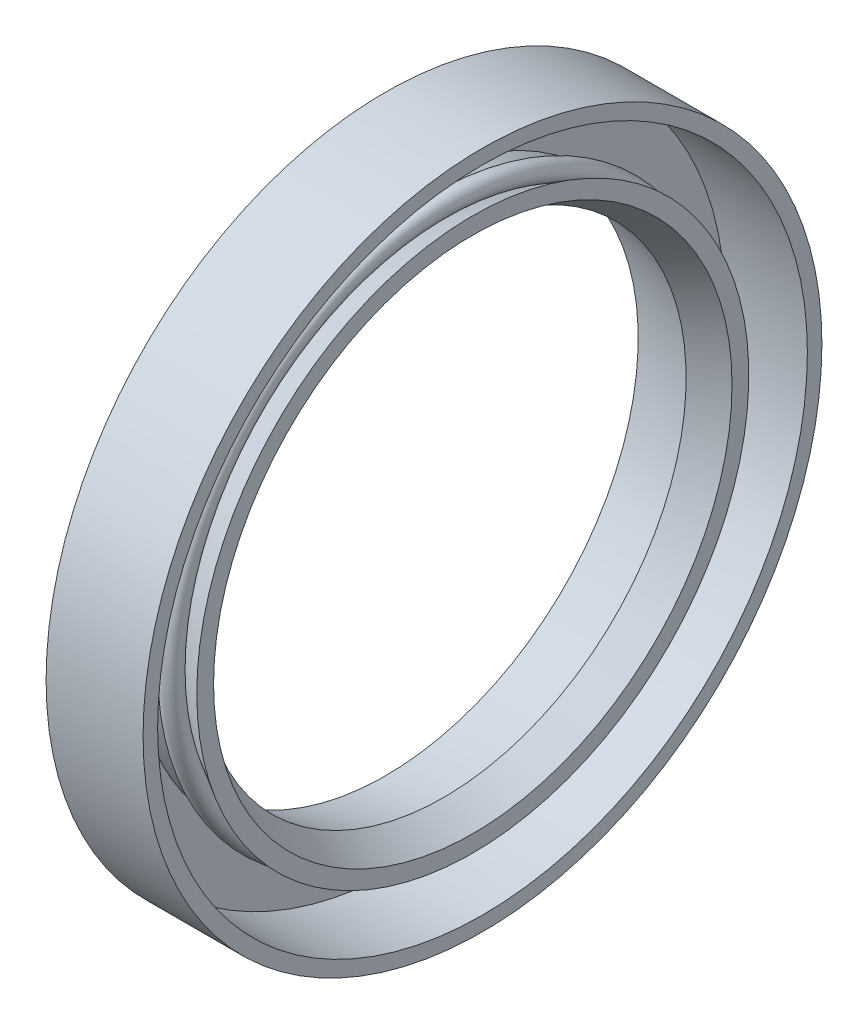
ISO-10303-21;
HEADER;
FILE_DESCRIPTION(('STEP AP214'),'2;1');
FILE_NAME('part.step','',(''),(''),'','','');
FILE_SCHEMA(('AUTOMOTIVE_DESIGN { 1 0 10303 214 1 1 1 1 }'));
ENDSEC;
DATA;
#1=APPLICATION_CONTEXT('core data for automotive mechanical design processes');
#2=APPLICATION_PROTOCOL_DEFINITION('international standard','automotive_design',2000,#1);
#3=PRODUCT_CONTEXT('',#1,'mechanical');
#4=PRODUCT('Part','Part','',(#3));
#5=PRODUCT_RELATED_PRODUCT_CATEGORY('part','',(#4));
#6=PRODUCT_DEFINITION_FORMATION('','',#4);
#7=PRODUCT_DEFINITION_CONTEXT('part definition',#1,'design');
#8=PRODUCT_DEFINITION('design','',#6,#7);
#9=PRODUCT_DEFINITION_SHAPE('','',#8);
#10=(LENGTH_UNIT() NAMED_UNIT(*) SI_UNIT(.MILLI.,.METRE.));
#11=(NAMED_UNIT(*) PLANE_ANGLE_UNIT() SI_UNIT($,.RADIAN.));
#12=(NAMED_UNIT(*) SI_UNIT($,.STERADIAN.) SOLID_ANGLE_UNIT());
#13=UNCERTAINTY_MEASURE_WITH_UNIT(LENGTH_MEASURE(1.E-05),#10,'distance_accuracy_value','');
#14=(GEOMETRIC_REPRESENTATION_CONTEXT(3) GLOBAL_UNCERTAINTY_ASSIGNED_CONTEXT((#13)) GLOBAL_UNIT_ASSIGNED_CONTEXT((#10,
#11,#12)) REPRESENTATION_CONTEXT('',''));
#15=CARTESIAN_POINT('',(0.,0.,0.));
#16=DIRECTION('',(0.,0.,1.));
#17=DIRECTION('',(1.,0.,0.));
#18=AXIS2_PLACEMENT_3D('',#15,#16,#17);
#19=CARTESIAN_POINT('',(5.53801867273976,0.,0.));
#20=DIRECTION('',(-1.,0.,0.));
#21=DIRECTION('',(0.,0.,1.));
#22=AXIS2_PLACEMENT_3D('',#19,#20,#21);
#23=TOROIDAL_SURFACE('',#22,27.6200263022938,1.);
#24=CARTESIAN_POINT('',(5.53801867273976,0.,28.6200263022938));
#25=VERTEX_POINT('',#24);
#26=VERTEX_LOOP('',#25);
#27=FACE_BOUND('',#26,.T.);
#28=ADVANCED_FACE('F446',(#27),#23,.T.);
#29=CLOSED_SHELL('',(#28));
#30=MANIFOLD_SOLID_BREP('B2',#29);
#31=CARTESIAN_POINT('',(0.,0.,0.));
#32=DIRECTION('',(-1.,0.,0.));
#33=DIRECTION('',(0.,0.,1.));
#34=AXIS2_PLACEMENT_3D('',#31,#32,#33);
#35=CONICAL_SURFACE('',#34,26.0579618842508,0.17453292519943);
#36=CARTESIAN_POINT('',(6.00000000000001,0.,0.));
#37=DIRECTION('',(-1.,0.,0.));
#38=DIRECTION('',(0.,0.,1.));
#39=AXIS2_PLACEMENT_3D('',#36,#37,#38);
#40=CIRCLE('',#39,25.);
#41=CARTESIAN_POINT('',(6.00000000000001,0.,25.));
#42=VERTEX_POINT('',#41);
#43=EDGE_CURVE('E445',#42,#42,#40,.T.);
#44=ORIENTED_EDGE('',*,*,#43,.F.);
#45=EDGE_LOOP('',(#44));
#46=FACE_BOUND('',#45,.T.);
#47=CARTESIAN_POINT('',(0.,0.,0.));
#48=DIRECTION('',(-1.,0.,0.));
#49=DIRECTION('',(0.,0.,1.));
#50=AXIS2_PLACEMENT_3D('',#47,#48,#49);
#51=CIRCLE('',#50,26.0579618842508);
#52=CARTESIAN_POINT('',(0.,0.,26.0579618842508));
#53=VERTEX_POINT('',#52);
#54=EDGE_CURVE('E491',#53,#53,#51,.T.);
#55=ORIENTED_EDGE('',*,*,#54,.T.);
#56=EDGE_LOOP('',(#55));
#57=FACE_BOUND('',#56,.T.);
#58=ADVANCED_FACE('F454',(#46,#57),#35,.F.);
#59=CARTESIAN_POINT('',(6.00000000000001,0.,0.));
#60=DIRECTION('',(1.,0.,0.));
#61=DIRECTION('',(0.,0.,-1.));
#62=AXIS2_PLACEMENT_3D('',#59,#60,#61);
#63=CONICAL_SURFACE('',#62,25.,0.523598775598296);
#64=CARTESIAN_POINT('',(9.00000000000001,0.,0.));
#65=DIRECTION('',(-1.,0.,0.));
#66=DIRECTION('',(0.,0.,1.));
#67=AXIS2_PLACEMENT_3D('',#64,#65,#66);
#68=CIRCLE('',#67,26.7320508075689);
#69=CARTESIAN_POINT('',(9.00000000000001,0.,26.7320508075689));
#70=VERTEX_POINT('',#69);
#71=EDGE_CURVE('E460',#70,#70,#68,.T.);
#72=ORIENTED_EDGE('',*,*,#71,.F.);
#73=EDGE_LOOP('',(#72));
#74=FACE_BOUND('',#73,.T.);
#75=ORIENTED_EDGE('',*,*,#43,.T.);
#76=EDGE_LOOP('',(#75));
#77=FACE_BOUND('',#76,.T.);
#78=ADVANCED_FACE('F546',(#74,#77),#63,.F.);
#79=CARTESIAN_POINT('',(9.00000000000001,28.4641016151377,0.));
#80=DIRECTION('',(-1.,0.,0.));
#81=DIRECTION('',(0.,0.,1.));
#82=AXIS2_PLACEMENT_3D('',#79,#80,#81);
#83=PLANE('',#82);
#84=CARTESIAN_POINT('',(9.00000000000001,0.,0.));
#85=DIRECTION('',(-1.,0.,0.));
#86=DIRECTION('',(0.,0.,1.));
#87=AXIS2_PLACEMENT_3D('',#84,#85,#86);
#88=CIRCLE('',#87,28.4641016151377);
#89=CARTESIAN_POINT('',(9.00000000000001,0.,28.4641016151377));
#90=VERTEX_POINT('',#89);
#91=EDGE_CURVE('E464',#90,#90,#88,.T.);
#92=ORIENTED_EDGE('',*,*,#91,.F.);
#93=EDGE_LOOP('',(#92));
#94=FACE_BOUND('',#93,.T.);
#95=ORIENTED_EDGE('',*,*,#71,.T.);
#96=EDGE_LOOP('',(#95));
#97=FACE_BOUND('',#96,.T.);
#98=ADVANCED_FACE('F541',(#94,#97),#83,.F.);
#99=CARTESIAN_POINT('',(9.00000000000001,0.,0.));
#100=DIRECTION('',(1.,0.,0.));
#101=DIRECTION('',(0.,0.,-1.));
#102=AXIS2_PLACEMENT_3D('',#99,#100,#101);
#103=CONICAL_SURFACE('',#102,28.4641016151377,0.523598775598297);
#104=CARTESIAN_POINT('',(6.03801867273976,0.,0.));
#105=DIRECTION('',(-1.,0.,0.));
#106=DIRECTION('',(0.,0.,1.));
#107=AXIS2_PLACEMENT_3D('',#104,#105,#106);
#108=CIRCLE('',#107,26.7540008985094);
#109=CARTESIAN_POINT('',(6.03801867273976,0.,26.7540008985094));
#110=VERTEX_POINT('',#109);
#111=EDGE_CURVE('E468',#110,#110,#108,.T.);
#112=ORIENTED_EDGE('',*,*,#111,.F.);
#113=EDGE_LOOP('',(#112));
#114=FACE_BOUND('',#113,.T.);
#115=ORIENTED_EDGE('',*,*,#91,.T.);
#116=EDGE_LOOP('',(#115));
#117=FACE_BOUND('',#116,.T.);
#118=ADVANCED_FACE('F535',(#114,#117),#103,.T.);
#119=CARTESIAN_POINT('',(5.53801867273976,0.,0.));
#120=DIRECTION('',(-1.,0.,0.));
#121=DIRECTION('',(0.,0.,1.));
#122=AXIS2_PLACEMENT_3D('',#119,#120,#121);
#123=TOROIDAL_SURFACE('',#122,27.6200263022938,1.);
#124=CARTESIAN_POINT('',(5.36437049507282,0.,0.));
#125=DIRECTION('',(-1.,0.,0.));
#126=DIRECTION('',(0.,0.,1.));
#127=AXIS2_PLACEMENT_3D('',#124,#125,#126);
#128=CIRCLE('',#127,26.6352185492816);
#129=CARTESIAN_POINT('',(5.36437049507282,0.,26.6352185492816));
#130=VERTEX_POINT('',#129);
#131=EDGE_CURVE('E473',#130,#130,#128,.T.);
#132=ORIENTED_EDGE('',*,*,#131,.F.);
#133=EDGE_LOOP('',(#132));
#134=FACE_BOUND('',#133,.T.);
#135=ORIENTED_EDGE('',*,*,#111,.T.);
#136=EDGE_LOOP('',(#135));
#137=FACE_BOUND('',#136,.T.);
#138=ADVANCED_FACE('F529',(#134,#137),#123,.F.);
#139=CARTESIAN_POINT('',(5.36437049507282,0.,0.));
#140=DIRECTION('',(-1.,0.,0.));
#141=DIRECTION('',(0.,0.,1.));
#142=AXIS2_PLACEMENT_3D('',#139,#140,#141);
#143=CONICAL_SURFACE('',#142,26.6352185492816,0.174532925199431);
#144=CARTESIAN_POINT('',(1.5,0.,0.));
#145=DIRECTION('',(-1.,0.,0.));
#146=DIRECTION('',(0.,0.,1.));
#147=AXIS2_PLACEMENT_3D('',#144,#145,#146);
#148=CIRCLE('',#147,27.3166113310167);
#149=CARTESIAN_POINT('',(1.5,0.,27.3166113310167));
#150=VERTEX_POINT('',#149);
#151=EDGE_CURVE('E476',#150,#150,#148,.T.);
#152=ORIENTED_EDGE('',*,*,#151,.F.);
#153=EDGE_LOOP('',(#152));
#154=FACE_BOUND('',#153,.T.);
#155=ORIENTED_EDGE('',*,*,#131,.T.);
#156=EDGE_LOOP('',(#155));
#157=FACE_BOUND('',#156,.T.);
#158=ADVANCED_FACE('F523',(#154,#157),#143,.T.);
#159=CARTESIAN_POINT('',(1.5,33.5,0.));
#160=DIRECTION('',(-1.,0.,0.));
#161=DIRECTION('',(0.,0.,1.));
#162=AXIS2_PLACEMENT_3D('',#159,#160,#161);
#163=PLANE('',#162);
#164=CARTESIAN_POINT('',(1.5,0.,0.));
#165=DIRECTION('',(-1.,0.,0.));
#166=DIRECTION('',(0.,0.,1.));
#167=AXIS2_PLACEMENT_3D('',#164,#165,#166);
#168=CIRCLE('',#167,33.5);
#169=CARTESIAN_POINT('',(1.5,0.,33.5));
#170=VERTEX_POINT('',#169);
#171=EDGE_CURVE('E479',#170,#170,#168,.T.);
#172=ORIENTED_EDGE('',*,*,#171,.F.);
#173=EDGE_LOOP('',(#172));
#174=FACE_BOUND('',#173,.T.);
#175=ORIENTED_EDGE('',*,*,#151,.T.);
#176=EDGE_LOOP('',(#175));
#177=FACE_BOUND('',#176,.T.);
#178=ADVANCED_FACE('F517',(#174,#177),#163,.F.);
#179=CARTESIAN_POINT('',(-26.6044395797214,0.,0.));
#180=DIRECTION('',(-1.,0.,0.));
#181=DIRECTION('',(0.,0.,1.));
#182=AXIS2_PLACEMENT_3D('',#179,#180,#181);
#183=CYLINDRICAL_SURFACE('',#182,33.5);
#184=CARTESIAN_POINT('',(10.,0.,0.));
#185=DIRECTION('',(-1.,0.,0.));
#186=DIRECTION('',(0.,0.,1.));
#187=AXIS2_PLACEMENT_3D('',#184,#185,#186);
#188=CIRCLE('',#187,33.5);
#189=CARTESIAN_POINT('',(10.,0.,33.5));
#190=VERTEX_POINT('',#189);
#191=EDGE_CURVE('E482',#190,#190,#188,.T.);
#192=ORIENTED_EDGE('',*,*,#191,.F.);
#193=EDGE_LOOP('',(#192));
#194=FACE_BOUND('',#193,.T.);
#195=ORIENTED_EDGE('',*,*,#171,.T.);
#196=EDGE_LOOP('',(#195));
#197=FACE_BOUND('',#196,.T.);
#198=ADVANCED_FACE('F511',(#194,#197),#183,.F.);
#199=CARTESIAN_POINT('',(10.,35.,0.));
#200=DIRECTION('',(-1.,0.,0.));
#201=DIRECTION('',(0.,0.,1.));
#202=AXIS2_PLACEMENT_3D('',#199,#200,#201);
#203=PLANE('',#202);
#204=CARTESIAN_POINT('',(10.,0.,0.));
#205=DIRECTION('',(-1.,0.,0.));
#206=DIRECTION('',(0.,0.,1.));
#207=AXIS2_PLACEMENT_3D('',#204,#205,#206);
#208=CIRCLE('',#207,35.);
#209=CARTESIAN_POINT('',(10.,0.,35.));
#210=VERTEX_POINT('',#209);
#211=EDGE_CURVE('E485',#210,#210,#208,.T.);
#212=ORIENTED_EDGE('',*,*,#211,.F.);
#213=EDGE_LOOP('',(#212));
#214=FACE_BOUND('',#213,.T.);
#215=ORIENTED_EDGE('',*,*,#191,.T.);
#216=EDGE_LOOP('',(#215));
#217=FACE_BOUND('',#216,.T.);
#218=ADVANCED_FACE('F505',(#214,#217),#203,.F.);
#219=CARTESIAN_POINT('',(-26.6044395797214,0.,0.));
#220=DIRECTION('',(-1.,0.,0.));
#221=DIRECTION('',(0.,0.,1.));
#222=AXIS2_PLACEMENT_3D('',#219,#220,#221);
#223=CYLINDRICAL_SURFACE('',#222,35.);
#224=CARTESIAN_POINT('',(0.,0.,0.));
#225=DIRECTION('',(-1.,0.,0.));
#226=DIRECTION('',(0.,0.,1.));
#227=AXIS2_PLACEMENT_3D('',#224,#225,#226);
#228=CIRCLE('',#227,35.);
#229=CARTESIAN_POINT('',(0.,0.,35.));
#230=VERTEX_POINT('',#229);
#231=EDGE_CURVE('E488',#230,#230,#228,.T.);
#232=ORIENTED_EDGE('',*,*,#231,.F.);
#233=EDGE_LOOP('',(#232));
#234=FACE_BOUND('',#233,.T.);
#235=ORIENTED_EDGE('',*,*,#211,.T.);
#236=EDGE_LOOP('',(#235));
#237=FACE_BOUND('',#236,.T.);
#238=ADVANCED_FACE('F499',(#234,#237),#223,.T.);
#239=CARTESIAN_POINT('',(0.,26.0579618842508,0.));
#240=DIRECTION('',(1.,0.,0.));
#241=DIRECTION('',(0.,0.,-1.));
#242=AXIS2_PLACEMENT_3D('',#239,#240,#241);
#243=PLANE('',#242);
#244=ORIENTED_EDGE('',*,*,#54,.F.);
#245=EDGE_LOOP('',(#244));
#246=FACE_BOUND('',#245,.T.);
#247=ORIENTED_EDGE('',*,*,#231,.T.);
#248=EDGE_LOOP('',(#247));
#249=FACE_BOUND('',#248,.T.);
#250=ADVANCED_FACE('F496',(#246,#249),#243,.F.);
#251=CLOSED_SHELL('',(#58,#78,#98,#118,#138,#158,#178,#198,#218,#238,#250));
#252=MANIFOLD_SOLID_BREP('B6',#251);
#253=ADVANCED_BREP_SHAPE_REPRESENTATION('',(#18,#30,#252),#14);
#254=SHAPE_DEFINITION_REPRESENTATION(#9,#253);
ENDSEC;
END-ISO-10303-21;
